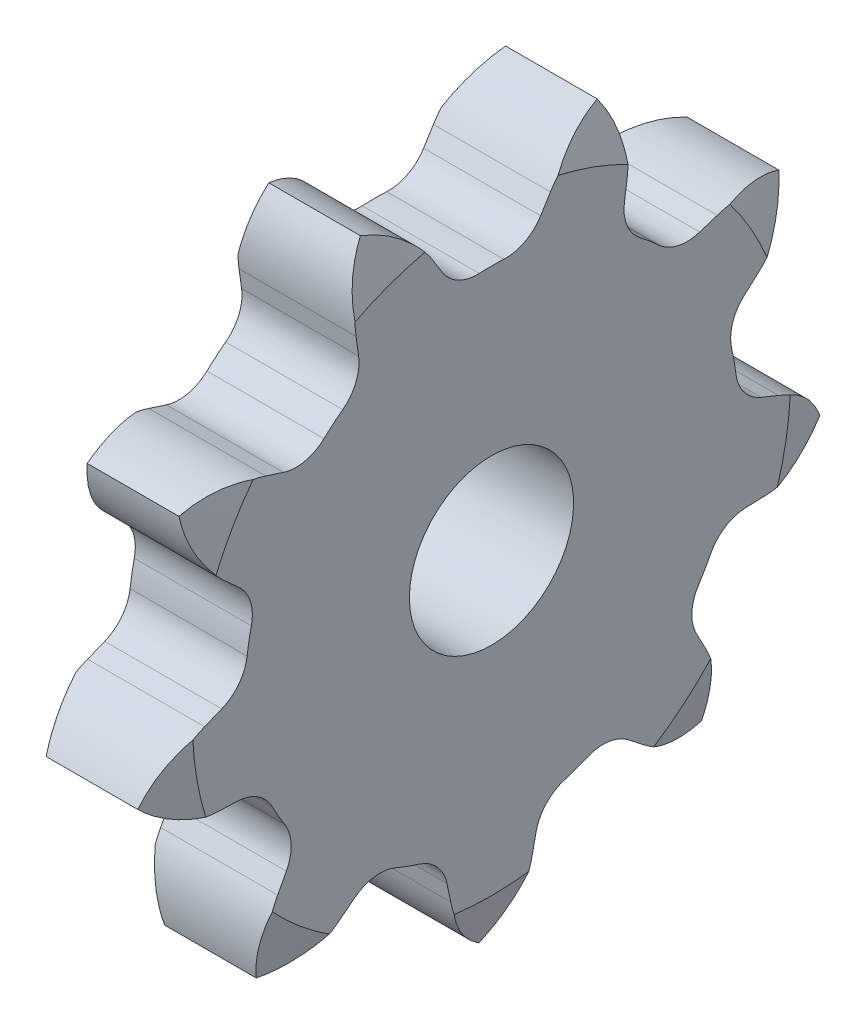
from build123d import *

# Parameters (mm, degrees)
TOOTHCUT_DEPTH  = 158.936618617
TEETHCUTS_COUNT = 9
TEETHCUTS_ANGLE = 320
BORSKE_R        = 25.4
BORE_DEPTH      = 76.2000508


with BuildPart() as part:
    # BasProSke → Base-Revolve (revolve)
    with BuildSketch(Plane(origin=(0, 0, 0), x_dir=(1, 0, 0), z_dir=(0, 1, 0)), mode=Mode.PRIVATE) as base_revolve_sk:
        Polygon((0, 0), (0, 92.496000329), (4.3434, 108.705789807), (31.8516, 108.705789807), (36.195, 92.496000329), (36.195, 0), align=None)
    revolve(base_revolve_sk.sketch.rotate(Axis((-10, 0, 0), (1, 0, 0)), 180), axis=Axis((-10, 0, 0), (1, 0, 0)))

    # TooCutSke → ToothCut (cut, through all)
    with BuildSketch(Plane(origin=(0, 0, 0), x_dir=(0, 0, -1), z_dir=(1, 0, 0))):
        with BuildLine():
            Line((-15.194101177, 82.053667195), (-18.222589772, 86.900262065))
            ThreePointArc((-18.222589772, 86.900262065), (-26.141043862, 95.507464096), (-36.638602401, 100.663732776))
            Line((-36.638602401, 100.663732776), (-40.982258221, 112.59782906))
            ThreePointArc((-40.982258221, 112.59782906), (0, 119.824106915), (40.982258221, 112.59782906))
            Line((40.982258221, 112.59782906), (36.638602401, 100.663732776))
            ThreePointArc((36.638602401, 100.663732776), (26.141043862, 95.507464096), (18.222589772, 86.900262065))
            Line((18.222589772, 86.900262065), (15.194101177, 82.053667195))
            ThreePointArc((15.194101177, 82.053667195), (10.302586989, 77.526158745), (3.791861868, 76.099378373))
            ThreePointArc((3.791861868, 76.099378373), (0, 76.193789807), (-3.791861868, 76.099378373))
            ThreePointArc((-3.791861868, 76.099378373), (-10.302586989, 77.526158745), (-15.194101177, 82.053667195))
        make_face()
    toothcut = extrude(amount=TOOTHCUT_DEPTH, mode=Mode.SUBTRACT)

    # TeethCuts: ToothCut ×9 about axis
    teethcuts_axis = Axis((-10, 0, 0), (1, 0, 0))
    for i in range(1, TEETHCUTS_COUNT):
        add(toothcut.rotate(teethcuts_axis, i * TEETHCUTS_ANGLE / (TEETHCUTS_COUNT - 1)), mode=Mode.SUBTRACT)

    # BorSke → Bore (cut, symmetric)
    with BuildSketch(Plane(origin=(0, 0, 0), x_dir=(0, 0, -1), z_dir=(1, 0, 0))):
        with Locations(Location((0, 0, 0), (0, 0, 180))):
            Circle(BORSKE_R)
    extrude(amount=BORE_DEPTH, both=True, mode=Mode.SUBTRACT)


solid = part.part
